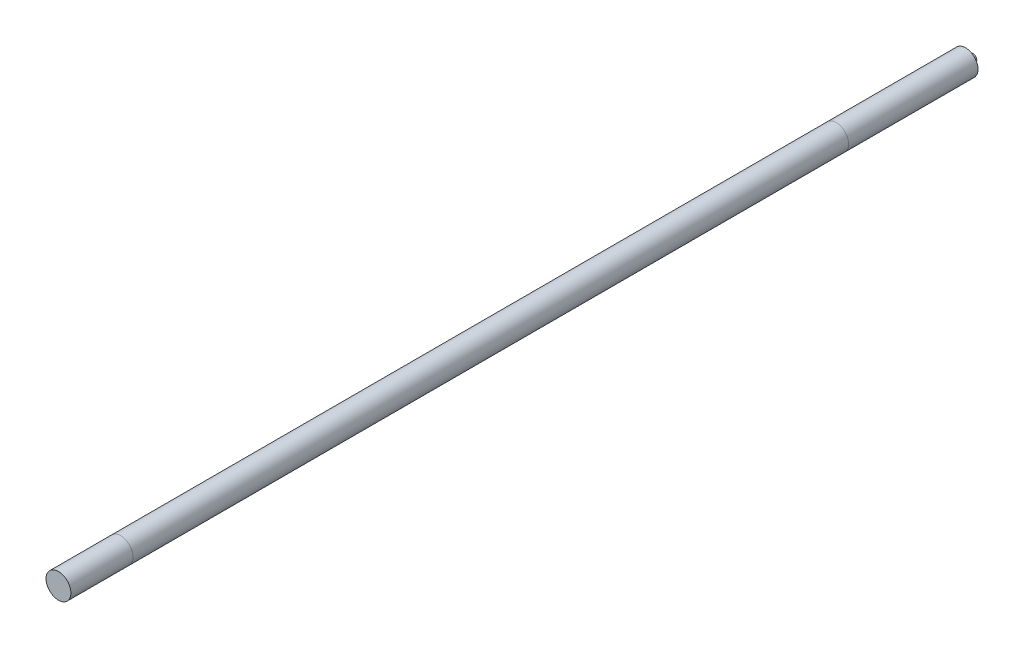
ISO-10303-21;
HEADER;
FILE_DESCRIPTION(('STEP AP214'),'2;1');
FILE_NAME('part.step','',(''),(''),'','','');
FILE_SCHEMA(('AUTOMOTIVE_DESIGN { 1 0 10303 214 1 1 1 1 }'));
ENDSEC;
DATA;
#1=APPLICATION_CONTEXT('core data for automotive mechanical design processes');
#2=APPLICATION_PROTOCOL_DEFINITION('international standard','automotive_design',2000,#1);
#3=PRODUCT_CONTEXT('',#1,'mechanical');
#4=PRODUCT('Part','Part','',(#3));
#5=PRODUCT_RELATED_PRODUCT_CATEGORY('part','',(#4));
#6=PRODUCT_DEFINITION_FORMATION('','',#4);
#7=PRODUCT_DEFINITION_CONTEXT('part definition',#1,'design');
#8=PRODUCT_DEFINITION('design','',#6,#7);
#9=PRODUCT_DEFINITION_SHAPE('','',#8);
#10=(LENGTH_UNIT() NAMED_UNIT(*) SI_UNIT(.MILLI.,.METRE.));
#11=(NAMED_UNIT(*) PLANE_ANGLE_UNIT() SI_UNIT($,.RADIAN.));
#12=(NAMED_UNIT(*) SI_UNIT($,.STERADIAN.) SOLID_ANGLE_UNIT());
#13=UNCERTAINTY_MEASURE_WITH_UNIT(LENGTH_MEASURE(1.E-05),#10,'distance_accuracy_value','');
#14=(GEOMETRIC_REPRESENTATION_CONTEXT(3) GLOBAL_UNCERTAINTY_ASSIGNED_CONTEXT((#13)) GLOBAL_UNIT_ASSIGNED_CONTEXT((#10,
#11,#12)) REPRESENTATION_CONTEXT('',''));
#15=CARTESIAN_POINT('',(0.,0.,0.));
#16=DIRECTION('',(0.,0.,1.));
#17=DIRECTION('',(1.,0.,0.));
#18=AXIS2_PLACEMENT_3D('',#15,#16,#17);
#19=CARTESIAN_POINT('',(0.,0.,735.));
#20=DIRECTION('',(0.,0.,-1.));
#21=DIRECTION('',(-1.,0.,0.));
#22=AXIS2_PLACEMENT_3D('',#19,#20,#21);
#23=CYLINDRICAL_SURFACE('',#22,10.);
#24=CARTESIAN_POINT('',(0.,0.,110.));
#25=DIRECTION('',(0.,0.,1.));
#26=DIRECTION('',(1.,0.,0.));
#27=AXIS2_PLACEMENT_3D('',#24,#25,#26);
#28=CIRCLE('',#27,10.);
#29=CARTESIAN_POINT('',(10.,0.,110.));
#30=VERTEX_POINT('',#29);
#31=EDGE_CURVE('E10',#30,#30,#28,.T.);
#32=ORIENTED_EDGE('',*,*,#31,.F.);
#33=EDGE_LOOP('',(#32));
#34=FACE_BOUND('',#33,.T.);
#35=CARTESIAN_POINT('',(0.,0.,6.00000000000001));
#36=DIRECTION('',(0.,0.,-1.));
#37=DIRECTION('',(-1.,0.,0.));
#38=AXIS2_PLACEMENT_3D('',#35,#36,#37);
#39=CIRCLE('',#38,10.);
#40=CARTESIAN_POINT('',(-10.,0.,6.00000000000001));
#41=VERTEX_POINT('',#40);
#42=EDGE_CURVE('E28',#41,#41,#39,.T.);
#43=ORIENTED_EDGE('',*,*,#42,.F.);
#44=EDGE_LOOP('',(#43));
#45=FACE_BOUND('',#44,.T.);
#46=ADVANCED_FACE('F24',(#34,#45),#23,.T.);
#47=CARTESIAN_POINT('',(0.,0.,735.));
#48=DIRECTION('',(0.,0.,1.));
#49=DIRECTION('',(1.,0.,0.));
#50=AXIS2_PLACEMENT_3D('',#47,#48,#49);
#51=CIRCLE('',#50,10.);
#52=CARTESIAN_POINT('',(10.,0.,735.));
#53=VERTEX_POINT('',#52);
#54=EDGE_CURVE('E40',#53,#53,#51,.T.);
#55=ORIENTED_EDGE('',*,*,#54,.F.);
#56=EDGE_LOOP('',(#55));
#57=FACE_BOUND('',#56,.T.);
#58=CARTESIAN_POINT('',(0.,0.,685.));
#59=DIRECTION('',(0.,0.,-1.));
#60=DIRECTION('',(-1.,0.,0.));
#61=AXIS2_PLACEMENT_3D('',#58,#59,#60);
#62=CIRCLE('',#61,10.);
#63=CARTESIAN_POINT('',(-10.,0.,685.));
#64=VERTEX_POINT('',#63);
#65=EDGE_CURVE('E33',#64,#64,#62,.T.);
#66=ORIENTED_EDGE('',*,*,#65,.F.);
#67=EDGE_LOOP('',(#66));
#68=FACE_BOUND('',#67,.T.);
#69=ADVANCED_FACE('F68',(#57,#68),#23,.T.);
#70=ORIENTED_EDGE('',*,*,#31,.T.);
#71=EDGE_LOOP('',(#70));
#72=FACE_BOUND('',#71,.T.);
#73=ORIENTED_EDGE('',*,*,#65,.T.);
#74=EDGE_LOOP('',(#73));
#75=FACE_BOUND('',#74,.T.);
#76=ADVANCED_FACE('F26',(#72,#75),#23,.T.);
#77=CARTESIAN_POINT('',(0.,0.,735.));
#78=DIRECTION('',(0.,0.,1.));
#79=DIRECTION('',(1.,0.,0.));
#80=AXIS2_PLACEMENT_3D('',#77,#78,#79);
#81=PLANE('',#80);
#82=ORIENTED_EDGE('',*,*,#54,.T.);
#83=EDGE_LOOP('',(#82));
#84=FACE_BOUND('',#83,.T.);
#85=ADVANCED_FACE('F64',(#84),#81,.T.);
#86=CARTESIAN_POINT('',(0.,0.,6.));
#87=DIRECTION('',(0.,0.,-1.));
#88=DIRECTION('',(-1.,0.,0.));
#89=AXIS2_PLACEMENT_3D('',#86,#87,#88);
#90=PLANE('',#89);
#91=CARTESIAN_POINT('',(0.,0.,6.));
#92=DIRECTION('',(0.,0.,-1.));
#93=DIRECTION('',(-1.,0.,0.));
#94=AXIS2_PLACEMENT_3D('',#91,#92,#93);
#95=CIRCLE('',#94,3.);
#96=CARTESIAN_POINT('',(-3.,0.,6.));
#97=VERTEX_POINT('',#96);
#98=EDGE_CURVE('E45',#97,#97,#95,.T.);
#99=ORIENTED_EDGE('',*,*,#98,.F.);
#100=EDGE_LOOP('',(#99));
#101=FACE_BOUND('',#100,.T.);
#102=ORIENTED_EDGE('',*,*,#42,.T.);
#103=EDGE_LOOP('',(#102));
#104=FACE_BOUND('',#103,.T.);
#105=ADVANCED_FACE('F56',(#101,#104),#90,.T.);
#106=CARTESIAN_POINT('',(0.,0.,6.));
#107=DIRECTION('',(0.,0.,-1.));
#108=DIRECTION('',(-1.,0.,0.));
#109=AXIS2_PLACEMENT_3D('',#106,#107,#108);
#110=CYLINDRICAL_SURFACE('',#109,3.);
#111=ORIENTED_EDGE('',*,*,#98,.T.);
#112=EDGE_LOOP('',(#111));
#113=FACE_BOUND('',#112,.T.);
#114=CARTESIAN_POINT('',(0.,0.,0.));
#115=DIRECTION('',(0.,0.,-1.));
#116=DIRECTION('',(-1.,0.,0.));
#117=AXIS2_PLACEMENT_3D('',#114,#115,#116);
#118=CIRCLE('',#117,3.);
#119=CARTESIAN_POINT('',(-3.,0.,0.));
#120=VERTEX_POINT('',#119);
#121=EDGE_CURVE('E48',#120,#120,#118,.T.);
#122=ORIENTED_EDGE('',*,*,#121,.F.);
#123=EDGE_LOOP('',(#122));
#124=FACE_BOUND('',#123,.T.);
#125=ADVANCED_FACE('F54',(#113,#124),#110,.T.);
#126=CARTESIAN_POINT('',(0.,0.,0.));
#127=DIRECTION('',(0.,0.,1.));
#128=DIRECTION('',(1.,0.,0.));
#129=AXIS2_PLACEMENT_3D('',#126,#127,#128);
#130=PLANE('',#129);
#131=ORIENTED_EDGE('',*,*,#121,.T.);
#132=EDGE_LOOP('',(#131));
#133=FACE_BOUND('',#132,.T.);
#134=ADVANCED_FACE('F52',(#133),#130,.F.);
#135=CLOSED_SHELL('',(#46,#69,#76,#85,#105,#125,#134));
#136=MANIFOLD_SOLID_BREP('B2',#135);
#137=ADVANCED_BREP_SHAPE_REPRESENTATION('',(#18,#136),#14);
#138=SHAPE_DEFINITION_REPRESENTATION(#9,#137);
ENDSEC;
END-ISO-10303-21;
